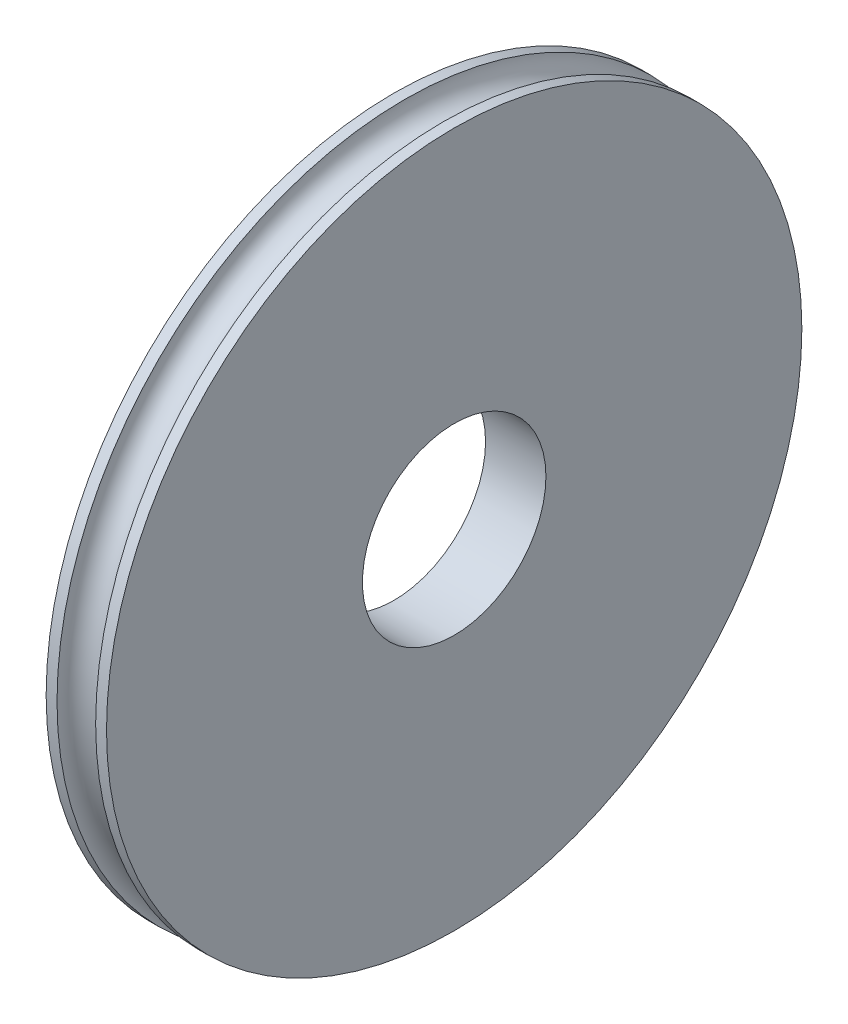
ISO-10303-21;
HEADER;
FILE_DESCRIPTION(('STEP AP214'),'2;1');
FILE_NAME('part.step','',(''),(''),'','','');
FILE_SCHEMA(('AUTOMOTIVE_DESIGN { 1 0 10303 214 1 1 1 1 }'));
ENDSEC;
DATA;
#1=APPLICATION_CONTEXT('core data for automotive mechanical design processes');
#2=APPLICATION_PROTOCOL_DEFINITION('international standard','automotive_design',2000,#1);
#3=PRODUCT_CONTEXT('',#1,'mechanical');
#4=PRODUCT('Part','Part','',(#3));
#5=PRODUCT_RELATED_PRODUCT_CATEGORY('part','',(#4));
#6=PRODUCT_DEFINITION_FORMATION('','',#4);
#7=PRODUCT_DEFINITION_CONTEXT('part definition',#1,'design');
#8=PRODUCT_DEFINITION('design','',#6,#7);
#9=PRODUCT_DEFINITION_SHAPE('','',#8);
#10=(LENGTH_UNIT() NAMED_UNIT(*) SI_UNIT(.MILLI.,.METRE.));
#11=(NAMED_UNIT(*) PLANE_ANGLE_UNIT() SI_UNIT($,.RADIAN.));
#12=(NAMED_UNIT(*) SI_UNIT($,.STERADIAN.) SOLID_ANGLE_UNIT());
#13=UNCERTAINTY_MEASURE_WITH_UNIT(LENGTH_MEASURE(1.E-05),#10,'distance_accuracy_value','');
#14=(GEOMETRIC_REPRESENTATION_CONTEXT(3) GLOBAL_UNCERTAINTY_ASSIGNED_CONTEXT((#13)) GLOBAL_UNIT_ASSIGNED_CONTEXT((#10,
#11,#12)) REPRESENTATION_CONTEXT('',''));
#15=CARTESIAN_POINT('',(0.,0.,0.));
#16=DIRECTION('',(0.,0.,1.));
#17=DIRECTION('',(1.,0.,0.));
#18=AXIS2_PLACEMENT_3D('',#15,#16,#17);
#19=CARTESIAN_POINT('',(-3.125,0.,0.));
#20=DIRECTION('',(1.,0.,0.));
#21=DIRECTION('',(0.,1.,0.));
#22=AXIS2_PLACEMENT_3D('',#19,#20,#21);
#23=PLANE('',#22);
#24=CARTESIAN_POINT('',(-3.12500000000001,0.,0.));
#25=DIRECTION('',(1.,0.,0.));
#26=DIRECTION('',(0.,0.,-1.));
#27=AXIS2_PLACEMENT_3D('',#24,#25,#26);
#28=CIRCLE('',#27,9.5);
#29=CARTESIAN_POINT('',(-3.12500000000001,0.,-9.5));
#30=VERTEX_POINT('',#29);
#31=EDGE_CURVE('E51',#30,#30,#28,.T.);
#32=ORIENTED_EDGE('',*,*,#31,.T.);
#33=EDGE_LOOP('',(#32));
#34=FACE_BOUND('',#33,.T.);
#35=CARTESIAN_POINT('',(-3.12499999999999,0.,0.));
#36=DIRECTION('',(-1.,0.,0.));
#37=DIRECTION('',(0.,-1.,0.));
#38=AXIS2_PLACEMENT_3D('',#35,#36,#37);
#39=CIRCLE('',#38,36.);
#40=CARTESIAN_POINT('',(-3.12499999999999,-36.,0.));
#41=VERTEX_POINT('',#40);
#42=EDGE_CURVE('E46',#41,#41,#39,.T.);
#43=ORIENTED_EDGE('',*,*,#42,.T.);
#44=EDGE_LOOP('',(#43));
#45=FACE_BOUND('',#44,.T.);
#46=ADVANCED_FACE('F32',(#34,#45),#23,.F.);
#47=CARTESIAN_POINT('',(3.125,0.,0.));
#48=DIRECTION('',(-1.,0.,0.));
#49=DIRECTION('',(0.,-1.,0.));
#50=AXIS2_PLACEMENT_3D('',#47,#48,#49);
#51=PLANE('',#50);
#52=CARTESIAN_POINT('',(3.125,0.,0.));
#53=DIRECTION('',(1.,0.,0.));
#54=DIRECTION('',(0.,0.,-1.));
#55=AXIS2_PLACEMENT_3D('',#52,#53,#54);
#56=CIRCLE('',#55,9.5);
#57=CARTESIAN_POINT('',(3.125,0.,-9.5));
#58=VERTEX_POINT('',#57);
#59=EDGE_CURVE('E54',#58,#58,#56,.T.);
#60=ORIENTED_EDGE('',*,*,#59,.F.);
#61=EDGE_LOOP('',(#60));
#62=FACE_BOUND('',#61,.T.);
#63=CARTESIAN_POINT('',(3.12500000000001,0.,0.));
#64=DIRECTION('',(-1.,0.,0.));
#65=DIRECTION('',(0.,-1.,0.));
#66=AXIS2_PLACEMENT_3D('',#63,#64,#65);
#67=CIRCLE('',#66,36.);
#68=CARTESIAN_POINT('',(3.12500000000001,-36.,0.));
#69=VERTEX_POINT('',#68);
#70=EDGE_CURVE('E10',#69,#69,#67,.T.);
#71=ORIENTED_EDGE('',*,*,#70,.F.);
#72=EDGE_LOOP('',(#71));
#73=FACE_BOUND('',#72,.T.);
#74=ADVANCED_FACE('F60',(#62,#73),#51,.F.);
#75=CARTESIAN_POINT('',(-22.9962185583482,0.,0.));
#76=DIRECTION('',(-1.,0.,0.));
#77=DIRECTION('',(0.,-1.,0.));
#78=AXIS2_PLACEMENT_3D('',#75,#76,#77);
#79=CYLINDRICAL_SURFACE('',#78,36.);
#80=CARTESIAN_POINT('',(2.00000000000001,0.,0.));
#81=DIRECTION('',(-1.,0.,0.));
#82=DIRECTION('',(0.,-1.,0.));
#83=AXIS2_PLACEMENT_3D('',#80,#81,#82);
#84=CIRCLE('',#83,36.);
#85=CARTESIAN_POINT('',(2.00000000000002,-36.,0.));
#86=VERTEX_POINT('',#85);
#87=EDGE_CURVE('E38',#86,#86,#84,.T.);
#88=ORIENTED_EDGE('',*,*,#87,.F.);
#89=EDGE_LOOP('',(#88));
#90=FACE_BOUND('',#89,.T.);
#91=ORIENTED_EDGE('',*,*,#70,.T.);
#92=EDGE_LOOP('',(#91));
#93=FACE_BOUND('',#92,.T.);
#94=ADVANCED_FACE('F63',(#90,#93),#79,.T.);
#95=CARTESIAN_POINT('',(0.,0.,0.));
#96=DIRECTION('',(-1.,0.,0.));
#97=DIRECTION('',(0.,-1.,0.));
#98=AXIS2_PLACEMENT_3D('',#95,#96,#97);
#99=TOROIDAL_SURFACE('',#98,36.,2.);
#100=CARTESIAN_POINT('',(-1.99999999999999,0.,0.));
#101=DIRECTION('',(-1.,0.,0.));
#102=DIRECTION('',(0.,-1.,0.));
#103=AXIS2_PLACEMENT_3D('',#100,#101,#102);
#104=CIRCLE('',#103,36.);
#105=CARTESIAN_POINT('',(-1.99999999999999,-36.,0.));
#106=VERTEX_POINT('',#105);
#107=EDGE_CURVE('E42',#106,#106,#104,.T.);
#108=ORIENTED_EDGE('',*,*,#107,.F.);
#109=EDGE_LOOP('',(#108));
#110=FACE_BOUND('',#109,.T.);
#111=ORIENTED_EDGE('',*,*,#87,.T.);
#112=EDGE_LOOP('',(#111));
#113=FACE_BOUND('',#112,.T.);
#114=ADVANCED_FACE('F68',(#110,#113),#99,.F.);
#115=CARTESIAN_POINT('',(-22.9962185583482,0.,0.));
#116=DIRECTION('',(-1.,0.,0.));
#117=DIRECTION('',(0.,-1.,0.));
#118=AXIS2_PLACEMENT_3D('',#115,#116,#117);
#119=CYLINDRICAL_SURFACE('',#118,36.);
#120=ORIENTED_EDGE('',*,*,#42,.F.);
#121=EDGE_LOOP('',(#120));
#122=FACE_BOUND('',#121,.T.);
#123=ORIENTED_EDGE('',*,*,#107,.T.);
#124=EDGE_LOOP('',(#123));
#125=FACE_BOUND('',#124,.T.);
#126=ADVANCED_FACE('F75',(#122,#125),#119,.T.);
#127=CARTESIAN_POINT('',(3.125,0.,0.));
#128=DIRECTION('',(1.,0.,0.));
#129=DIRECTION('',(0.,0.,-1.));
#130=AXIS2_PLACEMENT_3D('',#127,#128,#129);
#131=CYLINDRICAL_SURFACE('',#130,9.5);
#132=ORIENTED_EDGE('',*,*,#31,.F.);
#133=EDGE_LOOP('',(#132));
#134=FACE_BOUND('',#133,.T.);
#135=ORIENTED_EDGE('',*,*,#59,.T.);
#136=EDGE_LOOP('',(#135));
#137=FACE_BOUND('',#136,.T.);
#138=ADVANCED_FACE('F58',(#134,#137),#131,.F.);
#139=CLOSED_SHELL('',(#46,#74,#94,#114,#126,#138));
#140=MANIFOLD_SOLID_BREP('B2',#139);
#141=ADVANCED_BREP_SHAPE_REPRESENTATION('',(#18,#140),#14);
#142=SHAPE_DEFINITION_REPRESENTATION(#9,#141);
ENDSEC;
END-ISO-10303-21;
